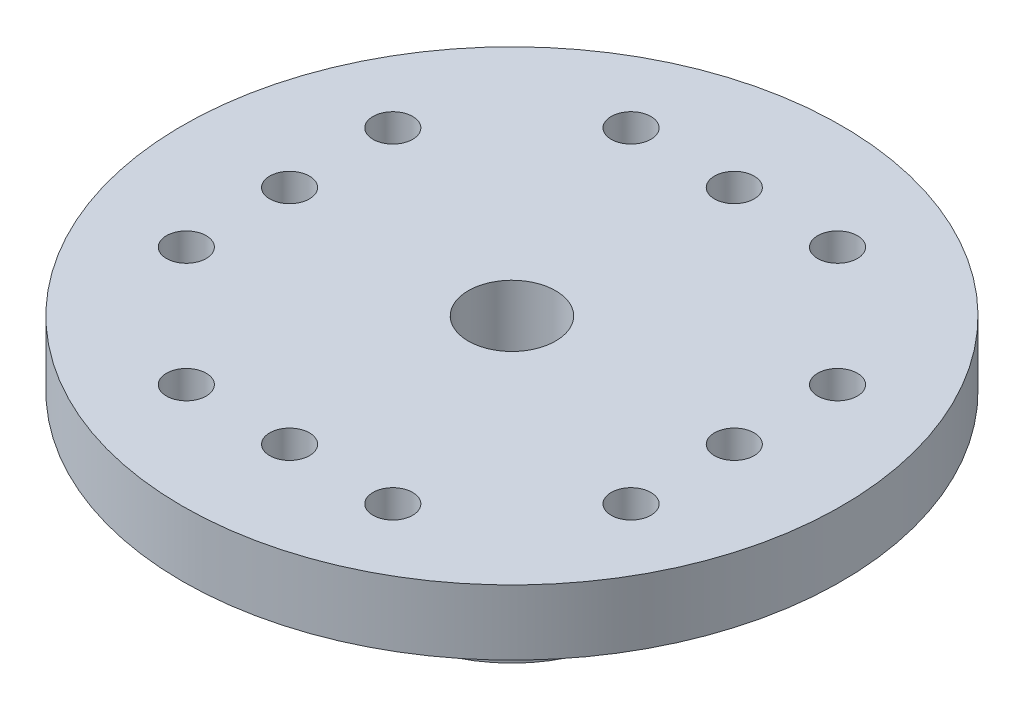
from build123d import *

# Parameters (mm, degrees)
SKETCH1_R           = 3.8354
SKETCH1_R_2         = 3.048
BOSS_EXTRUDE1_DEPTH = 4.826
SKETCH2_R           = 10.541
BOSS_EXTRUDE2_DEPTH = 2.0828
SKETCH3_R           = 1.397
CUT_EXTRUDE1_DEPTH  = 17.430364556
SKETCH4_R           = 0.635
CUT_EXTRUDE2_DEPTH  = 2.0828


with BuildPart() as part:
    # Sketch1 → Boss-Extrude1 (new body)
    with BuildSketch(Plane(origin=(0, 0, 0), x_dir=(1, 0, 0), z_dir=(0, 1, 0))):
        with Locations(Location((0, 0, 0), (0, 0, 270))):
            Circle(SKETCH1_R)
        with Locations(Location((0, 0, 0), (0, 0, 270))):
            Circle(SKETCH1_R_2, mode=Mode.SUBTRACT)
    extrude(amount=BOSS_EXTRUDE1_DEPTH)

    # Sketch2 → Boss-Extrude2 (add)
    with BuildSketch(Plane(origin=(0, 4.826, 0), x_dir=(1, 0, 0), z_dir=(0, 1, 0))):
        with Locations(Location((0, 0, 0), (0, 0, 270))):
            Circle(SKETCH2_R)
    extrude(amount=BOSS_EXTRUDE2_DEPTH)

    # Sketch3 → Cut-Extrude1 (cut, through all)
    with BuildSketch(Plane(origin=(0, 6.9088, 0), x_dir=(1, 0, 0), z_dir=(0, 1, 0))):
        with Locations(Location((0, 0, 0), (0, 0, 270))):
            Circle(SKETCH3_R)
    extrude(amount=-CUT_EXTRUDE1_DEPTH, mode=Mode.SUBTRACT)

    # Sketch4 → Cut-Extrude2 (cut)
    with BuildSketch(Plane(origin=(0, 6.9088, 0), x_dir=(1, 0, 0), z_dir=(0, 1, 0))):
        with Locations(Location((-7.112, 0, 0), (0, 0, 270))):
            Circle(SKETCH4_R)
        with Locations(Location((-7.112, 3.302, 0), (0, 0, 270))):
            Circle(SKETCH4_R)
        with Locations(Location((-7.112, -3.302, 0), (0, 0, 270))):
            Circle(SKETCH4_R)
        with Locations(Location((7.112, -3.302, 0), (0, 0, 90))):
            Circle(SKETCH4_R)
        with Locations(Location((7.112, 0, 0), (0, 0, 90))):
            Circle(SKETCH4_R)
        with Locations(Location((7.112, 3.302, 0), (0, 0, 90))):
            Circle(SKETCH4_R)
        with Locations(Location((3.302, 7.112, 0), (0, 0, 90))):
            Circle(SKETCH4_R)
        with Locations(Location((0, 7.112, 0), (0, 0, 90))):
            Circle(SKETCH4_R)
        with Locations(Location((-3.302, 7.112, 0), (0, 0, 90))):
            Circle(SKETCH4_R)
        with Locations(Location((3.302, -7.112, 0), (0, 0, 270))):
            Circle(SKETCH4_R)
        with Locations(Location((-3.302, -7.112, 0), (0, 0, 270))):
            Circle(SKETCH4_R)
        with Locations(Location((0, -7.112, 0), (0, 0, 270))):
            Circle(SKETCH4_R)
    extrude(amount=-CUT_EXTRUDE2_DEPTH, mode=Mode.SUBTRACT)


solid = part.part
